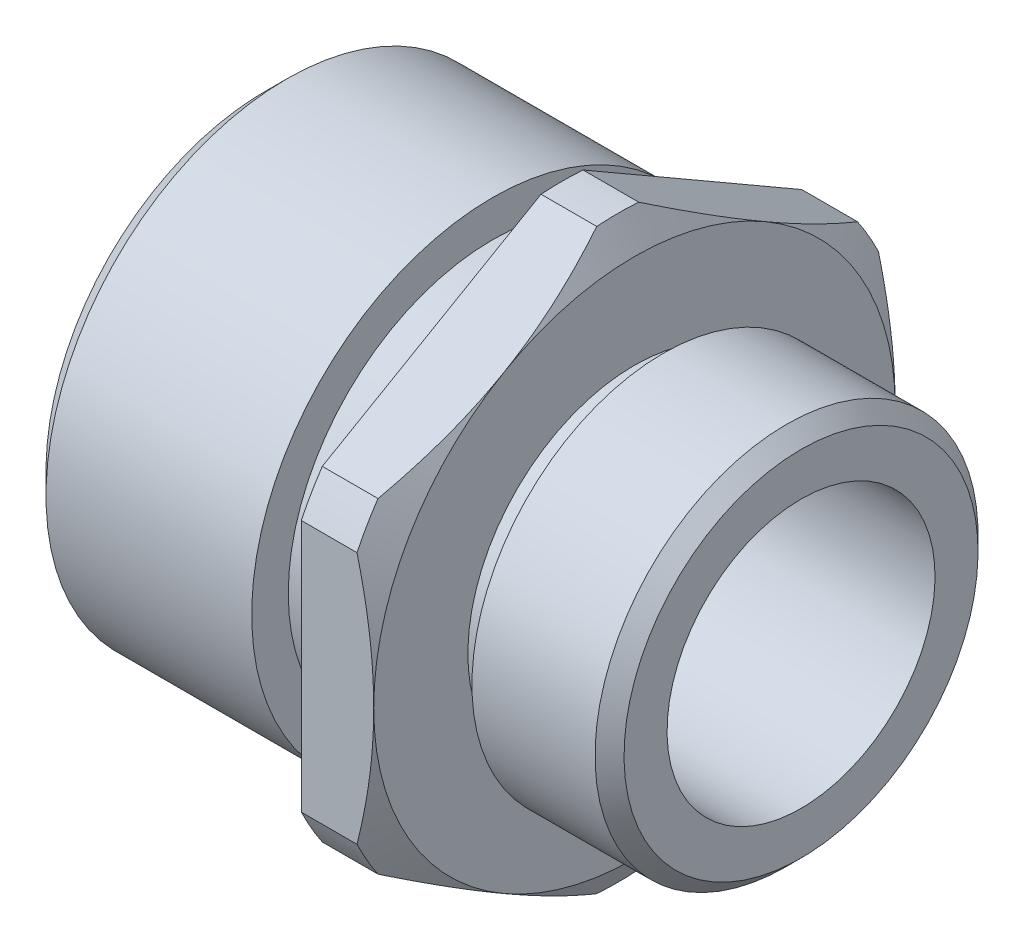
ISO-10303-21;
HEADER;
FILE_DESCRIPTION(('STEP AP214'),'2;1');
FILE_NAME('part.step','',(''),(''),'','','');
FILE_SCHEMA(('AUTOMOTIVE_DESIGN { 1 0 10303 214 1 1 1 1 }'));
ENDSEC;
DATA;
#1=APPLICATION_CONTEXT('core data for automotive mechanical design processes');
#2=APPLICATION_PROTOCOL_DEFINITION('international standard','automotive_design',2000,#1);
#3=PRODUCT_CONTEXT('',#1,'mechanical');
#4=PRODUCT('Part','Part','',(#3));
#5=PRODUCT_RELATED_PRODUCT_CATEGORY('part','',(#4));
#6=PRODUCT_DEFINITION_FORMATION('','',#4);
#7=PRODUCT_DEFINITION_CONTEXT('part definition',#1,'design');
#8=PRODUCT_DEFINITION('design','',#6,#7);
#9=PRODUCT_DEFINITION_SHAPE('','',#8);
#10=(LENGTH_UNIT() NAMED_UNIT(*) SI_UNIT(.MILLI.,.METRE.));
#11=(NAMED_UNIT(*) PLANE_ANGLE_UNIT() SI_UNIT($,.RADIAN.));
#12=(NAMED_UNIT(*) SI_UNIT($,.STERADIAN.) SOLID_ANGLE_UNIT());
#13=UNCERTAINTY_MEASURE_WITH_UNIT(LENGTH_MEASURE(1.E-05),#10,'distance_accuracy_value','');
#14=(GEOMETRIC_REPRESENTATION_CONTEXT(3) GLOBAL_UNCERTAINTY_ASSIGNED_CONTEXT((#13)) GLOBAL_UNIT_ASSIGNED_CONTEXT((#10,
#11,#12)) REPRESENTATION_CONTEXT('',''));
#15=CARTESIAN_POINT('',(0.,0.,0.));
#16=DIRECTION('',(0.,0.,1.));
#17=DIRECTION('',(1.,0.,0.));
#18=AXIS2_PLACEMENT_3D('',#15,#16,#17);
#19=CARTESIAN_POINT('',(-11.5,0.,0.));
#20=DIRECTION('',(-1.,0.,0.));
#21=DIRECTION('',(0.,-1.,0.));
#22=AXIS2_PLACEMENT_3D('',#19,#20,#21);
#23=CONICAL_SURFACE('',#22,18.,1.0471975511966);
#24=CARTESIAN_POINT('',(-12.6547005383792,0.,0.));
#25=DIRECTION('',(1.,0.,0.));
#26=DIRECTION('',(0.,1.,0.));
#27=AXIS2_PLACEMENT_3D('',#24,#25,#26);
#28=CIRCLE('',#27,20.);
#29=CARTESIAN_POINT('',(-12.6547005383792,8.71779788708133,-18.));
#30=VERTEX_POINT('',#29);
#31=CARTESIAN_POINT('',(-12.6547005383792,11.2295583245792,-16.5498344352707));
#32=VERTEX_POINT('',#31);
#33=EDGE_CURVE('E245',#30,#32,#28,.T.);
#34=ORIENTED_EDGE('',*,*,#33,.T.);
#35=CARTESIAN_POINT('',(-12.6549005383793,11.2291609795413,-16.5505226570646));
#36=CARTESIAN_POINT('',(-12.5432286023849,11.4510030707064,-16.1662808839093));
#37=CARTESIAN_POINT('',(-12.4380456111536,11.6736885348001,-15.780578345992));
#38=CARTESIAN_POINT('',(-12.2421753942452,12.1207153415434,-15.0063052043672));
#39=CARTESIAN_POINT('',(-12.151492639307,12.3450571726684,-14.6177337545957));
#40=CARTESIAN_POINT('',(-11.9860966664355,12.7955417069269,-13.8374716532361));
#41=CARTESIAN_POINT('',(-11.9114057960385,13.0216864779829,-13.4457774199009));
#42=CARTESIAN_POINT('',(-11.7796233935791,13.4752388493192,-12.6602016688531));
#43=CARTESIAN_POINT('',(-11.7225300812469,13.7026463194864,-12.2663203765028));
#44=CARTESIAN_POINT('',(-11.6281664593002,14.1537413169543,-11.4850009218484));
#45=CARTESIAN_POINT('',(-11.5905107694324,14.3774085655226,-11.0975978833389));
#46=CARTESIAN_POINT('',(-11.5341212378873,14.8253501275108,-10.3217403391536));
#47=CARTESIAN_POINT('',(-11.5153880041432,15.0496244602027,-9.93328580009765));
#48=CARTESIAN_POINT('',(-11.4973026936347,15.4981814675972,-9.15636227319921));
#49=CARTESIAN_POINT('',(-11.4979342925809,15.7224639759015,-8.76789357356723));
#50=CARTESIAN_POINT('',(-11.5185181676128,16.1707884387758,-7.99137282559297));
#51=CARTESIAN_POINT('',(-11.5384692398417,16.3948304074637,-7.60332075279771));
#52=CARTESIAN_POINT('',(-11.6044909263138,16.8975940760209,-6.73250853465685));
#53=CARTESIAN_POINT('',(-11.6557979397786,17.1761459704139,-6.25004250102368));
#54=CARTESIAN_POINT('',(-11.7859808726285,17.7316768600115,-5.28783477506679));
#55=CARTESIAN_POINT('',(-11.8648629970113,18.008655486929,-4.80809372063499));
#56=CARTESIAN_POINT('',(-12.0489456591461,18.5641863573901,-3.84588602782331));
#57=CARTESIAN_POINT('',(-12.1544829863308,18.8427103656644,-3.36346829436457));
#58=CARTESIAN_POINT('',(-12.388337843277,19.3971791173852,-2.40310024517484));
#59=CARTESIAN_POINT('',(-12.5166406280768,19.6731254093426,-1.92514724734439));
#60=CARTESIAN_POINT('',(-12.6549005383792,19.9477535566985,-1.44947734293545));
#61=B_SPLINE_CURVE_WITH_KNOTS('',3,(#35,#36,#37,#38,#39,#40,#41,#42,#43,#44,#45,#46,#47,#48,#49,
#50,#51,#52,#53,#54,#55,#56,#57,#58,#59,#60),.UNSPECIFIED.,.F.,.F.,(4,2,2,2,2,2,2,2,2,2,2,2,4),
(0.,1.3725940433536,2.74561047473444,4.12053325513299,5.4953168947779,6.84168124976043,
8.18808885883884,9.53336149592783,10.8785503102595,12.5561717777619,14.2341709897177,
15.934536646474,17.6338049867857),.UNSPECIFIED.);
#62=CARTESIAN_POINT('',(-11.5,15.5884572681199,-9.));
#63=VERTEX_POINT('',#62);
#64=EDGE_CURVE('E366',#32,#63,#61,.T.);
#65=ORIENTED_EDGE('',*,*,#64,.T.);
#66=CARTESIAN_POINT('',(-11.5,0.,0.));
#67=DIRECTION('',(1.,0.,0.));
#68=DIRECTION('',(0.,1.,0.));
#69=AXIS2_PLACEMENT_3D('',#66,#67,#68);
#70=CIRCLE('',#69,18.);
#71=CARTESIAN_POINT('',(-11.5,0.,-18.));
#72=VERTEX_POINT('',#71);
#73=EDGE_CURVE('E153',#72,#63,#70,.T.);
#74=ORIENTED_EDGE('',*,*,#73,.F.);
#75=CARTESIAN_POINT('',(-20.0831428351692,-27.4991426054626,-18.));
#76=CARTESIAN_POINT('',(-19.8923878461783,-27.1042498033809,-18.));
#77=CARTESIAN_POINT('',(-19.7026251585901,-26.708877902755,-18.));
#78=CARTESIAN_POINT('',(-19.3253123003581,-25.9170746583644,-18.));
#79=CARTESIAN_POINT('',(-19.1377621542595,-25.5206433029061,-18.));
#80=CARTESIAN_POINT('',(-18.5787176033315,-24.3294911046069,-18.));
#81=CARTESIAN_POINT('',(-18.210891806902,-23.5330415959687,-18.));
#82=CARTESIAN_POINT('',(-17.485292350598,-21.9300278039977,-18.));
#83=CARTESIAN_POINT('',(-17.1275888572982,-21.1234316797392,-18.));
#84=CARTESIAN_POINT('',(-16.4276306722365,-19.5035874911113,-18.));
#85=CARTESIAN_POINT('',(-16.0853751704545,-18.6903397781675,-18.));
#86=CARTESIAN_POINT('',(-15.416489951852,-17.0460964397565,-18.));
#87=CARTESIAN_POINT('',(-15.0900950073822,-16.2150048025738,-18.));
#88=CARTESIAN_POINT('',(-14.4630243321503,-14.5429906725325,-18.));
#89=CARTESIAN_POINT('',(-14.162351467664,-13.702067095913,-18.));
#90=CARTESIAN_POINT('',(-13.5948538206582,-12.0108273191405,-18.));
#91=CARTESIAN_POINT('',(-13.3279565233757,-11.160535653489,-18.));
#92=CARTESIAN_POINT('',(-12.8367057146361,-9.4477849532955,-18.));
#93=CARTESIAN_POINT('',(-12.6123386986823,-8.58532987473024,-18.));
#94=CARTESIAN_POINT('',(-12.3159268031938,-7.28235631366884,-18.));
#95=CARTESIAN_POINT('',(-12.2237952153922,-6.84637691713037,-18.));
#96=CARTESIAN_POINT('',(-12.0543745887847,-5.97152919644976,-18.));
#97=CARTESIAN_POINT('',(-11.9770852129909,-5.53266093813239,-18.));
#98=CARTESIAN_POINT('',(-11.8387227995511,-4.65233465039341,-18.));
#99=CARTESIAN_POINT('',(-11.7776507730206,-4.21087646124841,-18.));
#100=CARTESIAN_POINT('',(-11.6729517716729,-3.32588120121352,-18.));
#101=CARTESIAN_POINT('',(-11.6293248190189,-2.88234412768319,-18.));
#102=CARTESIAN_POINT('',(-11.5606870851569,-1.99661694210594,-18.));
#103=CARTESIAN_POINT('',(-11.5355614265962,-1.55443579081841,-18.));
#104=CARTESIAN_POINT('',(-11.5040574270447,-0.669408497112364,-18.));
#105=CARTESIAN_POINT('',(-11.4976788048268,-0.226562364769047,-18.));
#106=CARTESIAN_POINT('',(-11.503819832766,0.658879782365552,-18.));
#107=CARTESIAN_POINT('',(-11.5163343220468,1.10147583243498,-18.));
#108=CARTESIAN_POINT('',(-11.5599522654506,1.98575279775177,-18.));
#109=CARTESIAN_POINT('',(-11.5910565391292,2.42743367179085,-18.));
#110=CARTESIAN_POINT('',(-11.6884816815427,3.49963238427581,-18.));
#111=CARTESIAN_POINT('',(-11.7642107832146,4.12931183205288,-18.));
#112=CARTESIAN_POINT('',(-11.9492205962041,5.38369556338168,-18.));
#113=CARTESIAN_POINT('',(-12.0585063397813,6.00839908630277,-18.));
#114=CARTESIAN_POINT('',(-12.4312120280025,7.8761564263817,-18.));
#115=CARTESIAN_POINT('',(-12.7392300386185,9.1104114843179,-18.));
#116=CARTESIAN_POINT('',(-13.2698190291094,10.9565279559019,-18.));
#117=CARTESIAN_POINT('',(-13.460684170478,11.5780480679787,-18.));
#118=CARTESIAN_POINT('',(-13.8613113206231,12.815083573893,-18.));
#119=CARTESIAN_POINT('',(-14.0710750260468,13.4305984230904,-18.));
#120=CARTESIAN_POINT('',(-14.5050398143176,14.65255311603,-18.));
#121=CARTESIAN_POINT('',(-14.7291525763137,15.2590245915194,-18.));
#122=CARTESIAN_POINT('',(-15.0749595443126,16.1649196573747,-18.));
#123=CARTESIAN_POINT('',(-15.1918151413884,16.466200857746,-18.));
#124=CARTESIAN_POINT('',(-15.4284778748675,17.0675954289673,-18.));
#125=CARTESIAN_POINT('',(-15.5482849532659,17.3677088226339,-18.));
#126=CARTESIAN_POINT('',(-15.6694343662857,17.667278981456,-18.));
#127=B_SPLINE_CURVE_WITH_KNOTS('',3,(#75,#76,#77,#78,#79,#80,#81,#82,#83,#84,#85,#86,#87,#88,
#89,#90,#91,#92,#93,#94,#95,#96,#97,#98,#99,#100,#101,#102,#103,#104,#105,#106,#107,#108,#109,
#110,#111,#112,#113,#114,#115,#116,#117,#118,#119,#120,#121,#122,#123,#124,#125,#126),
.UNSPECIFIED.,.F.,.F.,(4,2,2,2,2,2,2,2,2,2,2,2,2,2,2,2,2,2,2,2,2,2,2,2,2,4),(0.,
1.31565319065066,2.63132096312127,5.26308805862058,7.91002567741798,10.5568243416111,
13.2351598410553,15.913793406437,18.5865748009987,21.2585060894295,22.595117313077,
23.9316981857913,25.2683623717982,26.6050282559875,27.9333229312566,29.2615976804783,
30.5895096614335,31.9174801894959,33.8190492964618,35.7209037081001,39.5319547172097,
41.4823037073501,43.4328279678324,45.3723255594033,46.3417605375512,47.3111764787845),.UNSPECIFIED.);
#128=EDGE_CURVE('E276',#72,#30,#127,.T.);
#129=ORIENTED_EDGE('',*,*,#128,.T.);
#130=EDGE_LOOP('',(#34,#65,#74,#129));
#131=FACE_BOUND('',#130,.T.);
#132=ADVANCED_FACE('F16',(#131),#23,.T.);
#133=CARTESIAN_POINT('',(-11.5,15.5884572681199,9.));
#134=VERTEX_POINT('',#133);
#135=EDGE_CURVE('E140',#63,#134,#70,.T.);
#136=ORIENTED_EDGE('',*,*,#135,.F.);
#137=CARTESIAN_POINT('',(-12.6547005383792,19.9473562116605,-1.45016556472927));
#138=VERTEX_POINT('',#137);
#139=EDGE_CURVE('E372',#63,#138,#61,.T.);
#140=ORIENTED_EDGE('',*,*,#139,.T.);
#141=CARTESIAN_POINT('',(-12.6547005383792,19.9473562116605,1.45016556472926));
#142=VERTEX_POINT('',#141);
#143=EDGE_CURVE('E143',#138,#142,#28,.T.);
#144=ORIENTED_EDGE('',*,*,#143,.T.);
#145=CARTESIAN_POINT('',(-12.6549005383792,19.9477535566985,1.44947734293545));
#146=CARTESIAN_POINT('',(-12.5432286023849,19.7259114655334,1.83371911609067));
#147=CARTESIAN_POINT('',(-12.4380456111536,19.5032260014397,2.21942165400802));
#148=CARTESIAN_POINT('',(-12.2421753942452,19.0561991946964,2.99369479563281));
#149=CARTESIAN_POINT('',(-12.151492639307,18.8318573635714,3.38226624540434));
#150=CARTESIAN_POINT('',(-11.9860966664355,18.3813728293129,4.16252834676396));
#151=CARTESIAN_POINT('',(-11.9114057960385,18.1552280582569,4.5542225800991));
#152=CARTESIAN_POINT('',(-11.7796233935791,17.7016756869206,5.33979833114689));
#153=CARTESIAN_POINT('',(-11.7225300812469,17.4742682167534,5.73367962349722));
#154=CARTESIAN_POINT('',(-11.6281664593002,17.0231732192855,6.51499907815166));
#155=CARTESIAN_POINT('',(-11.5905107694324,16.7995059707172,6.90240211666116));
#156=CARTESIAN_POINT('',(-11.5341212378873,16.351564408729,7.67825966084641));
#157=CARTESIAN_POINT('',(-11.5153880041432,16.1272900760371,8.06671419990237));
#158=CARTESIAN_POINT('',(-11.4973026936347,15.6787330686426,8.84363772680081));
#159=CARTESIAN_POINT('',(-11.4979342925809,15.4544505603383,9.2321064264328));
#160=CARTESIAN_POINT('',(-11.5185181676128,15.006126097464,10.0086271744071));
#161=CARTESIAN_POINT('',(-11.5384692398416,14.7820841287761,10.3966792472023));
#162=CARTESIAN_POINT('',(-11.6044909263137,14.2793204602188,11.2674914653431));
#163=CARTESIAN_POINT('',(-11.6557979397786,14.0007685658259,11.7499574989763));
#164=CARTESIAN_POINT('',(-11.7859808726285,13.4452376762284,12.7121652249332));
#165=CARTESIAN_POINT('',(-11.8648629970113,13.1682590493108,13.191906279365));
#166=CARTESIAN_POINT('',(-12.0489456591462,12.6127281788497,14.1541139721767));
#167=CARTESIAN_POINT('',(-12.1544829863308,12.3342041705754,14.6365317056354));
#168=CARTESIAN_POINT('',(-12.388337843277,11.7797354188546,15.5968997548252));
#169=CARTESIAN_POINT('',(-12.5166406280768,11.5037891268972,16.0748527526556));
#170=CARTESIAN_POINT('',(-12.6549005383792,11.2291609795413,16.5505226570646));
#171=B_SPLINE_CURVE_WITH_KNOTS('',3,(#145,#146,#147,#148,#149,#150,#151,#152,#153,#154,#155,
#156,#157,#158,#159,#160,#161,#162,#163,#164,#165,#166,#167,#168,#169,#170),.UNSPECIFIED.,.F.,
.F.,(4,2,2,2,2,2,2,2,2,2,2,2,4),(0.,1.37259404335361,2.74561047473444,4.120533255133,
5.49531689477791,6.84168124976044,8.18808885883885,9.53336149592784,10.8785503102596,
12.5561717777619,14.2341709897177,15.934536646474,17.6338049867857),.UNSPECIFIED.);
#172=EDGE_CURVE('E125',#142,#134,#171,.T.);
#173=ORIENTED_EDGE('',*,*,#172,.T.);
#174=EDGE_LOOP('',(#136,#140,#144,#173));
#175=FACE_BOUND('',#174,.T.);
#176=ADVANCED_FACE('F138',(#175),#23,.T.);
#177=CARTESIAN_POINT('',(-12.6547005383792,-11.2295583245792,-16.5498344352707));
#178=VERTEX_POINT('',#177);
#179=CARTESIAN_POINT('',(-12.6547005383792,-8.71779788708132,-18.));
#180=VERTEX_POINT('',#179);
#181=EDGE_CURVE('E361',#178,#180,#28,.T.);
#182=ORIENTED_EDGE('',*,*,#181,.T.);
#183=EDGE_CURVE('E278',#180,#72,#127,.T.);
#184=ORIENTED_EDGE('',*,*,#183,.T.);
#185=CARTESIAN_POINT('',(-11.5,-15.5884572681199,-9.));
#186=VERTEX_POINT('',#185);
#187=EDGE_CURVE('E369',#186,#72,#70,.T.);
#188=ORIENTED_EDGE('',*,*,#187,.F.);
#189=CARTESIAN_POINT('',(-12.6549005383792,-19.9477535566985,-1.44947734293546));
#190=CARTESIAN_POINT('',(-12.5432286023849,-19.7259114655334,-1.83371911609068));
#191=CARTESIAN_POINT('',(-12.4380456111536,-19.5032260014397,-2.21942165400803));
#192=CARTESIAN_POINT('',(-12.2421753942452,-19.0561991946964,-2.99369479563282));
#193=CARTESIAN_POINT('',(-12.151492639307,-18.8318573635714,-3.38226624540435));
#194=CARTESIAN_POINT('',(-11.9860966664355,-18.3813728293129,-4.16252834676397));
#195=CARTESIAN_POINT('',(-11.9114057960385,-18.1552280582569,-4.55422258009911));
#196=CARTESIAN_POINT('',(-11.7796233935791,-17.7016756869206,-5.33979833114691));
#197=CARTESIAN_POINT('',(-11.7225300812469,-17.4742682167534,-5.73367962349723));
#198=CARTESIAN_POINT('',(-11.6281664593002,-17.0231732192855,-6.51499907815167));
#199=CARTESIAN_POINT('',(-11.5905107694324,-16.7995059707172,-6.90240211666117));
#200=CARTESIAN_POINT('',(-11.5341212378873,-16.351564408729,-7.67825966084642));
#201=CARTESIAN_POINT('',(-11.5153880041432,-16.1272900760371,-8.06671419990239));
#202=CARTESIAN_POINT('',(-11.4973026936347,-15.6787330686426,-8.84363772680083));
#203=CARTESIAN_POINT('',(-11.4979342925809,-15.4544505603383,-9.23210642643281));
#204=CARTESIAN_POINT('',(-11.5185181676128,-15.006126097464,-10.0086271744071));
#205=CARTESIAN_POINT('',(-11.5384692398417,-14.7820841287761,-10.3966792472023));
#206=CARTESIAN_POINT('',(-11.6044909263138,-14.2793204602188,-11.2674914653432));
#207=CARTESIAN_POINT('',(-11.6557979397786,-14.0007685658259,-11.7499574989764));
#208=CARTESIAN_POINT('',(-11.7859808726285,-13.4452376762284,-12.7121652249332));
#209=CARTESIAN_POINT('',(-11.8648629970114,-13.1682590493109,-13.191906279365));
#210=CARTESIAN_POINT('',(-12.0489456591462,-12.6127281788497,-14.1541139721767));
#211=CARTESIAN_POINT('',(-12.1544829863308,-12.3342041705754,-14.6365317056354));
#212=CARTESIAN_POINT('',(-12.388337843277,-11.7797354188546,-15.5968997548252));
#213=CARTESIAN_POINT('',(-12.5166406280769,-11.5037891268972,-16.0748527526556));
#214=CARTESIAN_POINT('',(-12.6549005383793,-11.2291609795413,-16.5505226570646));
#215=B_SPLINE_CURVE_WITH_KNOTS('',3,(#189,#190,#191,#192,#193,#194,#195,#196,#197,#198,#199,
#200,#201,#202,#203,#204,#205,#206,#207,#208,#209,#210,#211,#212,#213,#214),.UNSPECIFIED.,.F.,
.F.,(4,2,2,2,2,2,2,2,2,2,2,2,4),(0.,1.3725940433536,2.74561047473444,4.120533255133,
5.4953168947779,6.84168124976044,8.18808885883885,9.53336149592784,10.8785503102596,
12.5561717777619,14.2341709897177,15.934536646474,17.6338049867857),.UNSPECIFIED.);
#216=EDGE_CURVE('E306',#186,#178,#215,.T.);
#217=ORIENTED_EDGE('',*,*,#216,.T.);
#218=EDGE_LOOP('',(#182,#184,#188,#217));
#219=FACE_BOUND('',#218,.T.);
#220=ADVANCED_FACE('F368',(#219),#23,.T.);
#221=CARTESIAN_POINT('',(-12.6547005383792,-19.9473562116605,1.45016556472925));
#222=VERTEX_POINT('',#221);
#223=CARTESIAN_POINT('',(-12.6547005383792,-19.9473562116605,-1.45016556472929));
#224=VERTEX_POINT('',#223);
#225=EDGE_CURVE('E358',#222,#224,#28,.T.);
#226=ORIENTED_EDGE('',*,*,#225,.T.);
#227=EDGE_CURVE('E280',#224,#186,#215,.T.);
#228=ORIENTED_EDGE('',*,*,#227,.T.);
#229=CARTESIAN_POINT('',(-11.5,-15.5884572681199,9.));
#230=VERTEX_POINT('',#229);
#231=EDGE_CURVE('E165',#230,#186,#70,.T.);
#232=ORIENTED_EDGE('',*,*,#231,.F.);
#233=CARTESIAN_POINT('',(-12.6549005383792,-11.2291609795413,16.5505226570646));
#234=CARTESIAN_POINT('',(-12.5432286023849,-11.4510030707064,16.1662808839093));
#235=CARTESIAN_POINT('',(-12.4380456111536,-11.6736885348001,15.780578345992));
#236=CARTESIAN_POINT('',(-12.2421753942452,-12.1207153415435,15.0063052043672));
#237=CARTESIAN_POINT('',(-12.151492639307,-12.3450571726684,14.6177337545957));
#238=CARTESIAN_POINT('',(-11.9860966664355,-12.7955417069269,13.8374716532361));
#239=CARTESIAN_POINT('',(-11.9114057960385,-13.0216864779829,13.4457774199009));
#240=CARTESIAN_POINT('',(-11.7796233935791,-13.4752388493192,12.6602016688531));
#241=CARTESIAN_POINT('',(-11.7225300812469,-13.7026463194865,12.2663203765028));
#242=CARTESIAN_POINT('',(-11.6281664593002,-14.1537413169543,11.4850009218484));
#243=CARTESIAN_POINT('',(-11.5905107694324,-14.3774085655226,11.0975978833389));
#244=CARTESIAN_POINT('',(-11.5341212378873,-14.8253501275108,10.3217403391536));
#245=CARTESIAN_POINT('',(-11.5153880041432,-15.0496244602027,9.93328580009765));
#246=CARTESIAN_POINT('',(-11.4973026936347,-15.4981814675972,9.15636227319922));
#247=CARTESIAN_POINT('',(-11.4979342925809,-15.7224639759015,8.76789357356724));
#248=CARTESIAN_POINT('',(-11.5185181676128,-16.1707884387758,7.99137282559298));
#249=CARTESIAN_POINT('',(-11.5384692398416,-16.3948304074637,7.60332075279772));
#250=CARTESIAN_POINT('',(-11.6044909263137,-16.8975940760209,6.73250853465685));
#251=CARTESIAN_POINT('',(-11.6557979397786,-17.1761459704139,6.25004250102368));
#252=CARTESIAN_POINT('',(-11.7859808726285,-17.7316768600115,5.28783477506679));
#253=CARTESIAN_POINT('',(-11.8648629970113,-18.008655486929,4.80809372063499));
#254=CARTESIAN_POINT('',(-12.0489456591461,-18.5641863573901,3.8458860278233));
#255=CARTESIAN_POINT('',(-12.1544829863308,-18.8427103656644,3.36346829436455));
#256=CARTESIAN_POINT('',(-12.388337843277,-19.3971791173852,2.40310024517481));
#257=CARTESIAN_POINT('',(-12.5166406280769,-19.6731254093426,1.92514724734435));
#258=CARTESIAN_POINT('',(-12.6549005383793,-19.9477535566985,1.4494773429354));
#259=B_SPLINE_CURVE_WITH_KNOTS('',3,(#233,#234,#235,#236,#237,#238,#239,#240,#241,#242,#243,
#244,#245,#246,#247,#248,#249,#250,#251,#252,#253,#254,#255,#256,#257,#258),.UNSPECIFIED.,.F.,
.F.,(4,2,2,2,2,2,2,2,2,2,2,2,4),(0.,1.3725940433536,2.74561047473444,4.12053325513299,
5.49531689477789,6.84168124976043,8.18808885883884,9.53336149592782,10.8785503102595,
12.5561717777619,14.2341709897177,15.934536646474,17.6338049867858),.UNSPECIFIED.);
#260=EDGE_CURVE('E316',#230,#222,#259,.T.);
#261=ORIENTED_EDGE('',*,*,#260,.T.);
#262=EDGE_LOOP('',(#226,#228,#232,#261));
#263=FACE_BOUND('',#262,.T.);
#264=ADVANCED_FACE('F412',(#263),#23,.T.);
#265=CARTESIAN_POINT('',(-12.6547005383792,-8.71779788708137,18.));
#266=VERTEX_POINT('',#265);
#267=CARTESIAN_POINT('',(-12.6547005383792,-11.2295583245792,16.5498344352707));
#268=VERTEX_POINT('',#267);
#269=EDGE_CURVE('E353',#266,#268,#28,.T.);
#270=ORIENTED_EDGE('',*,*,#269,.T.);
#271=EDGE_CURVE('E315',#268,#230,#259,.T.);
#272=ORIENTED_EDGE('',*,*,#271,.T.);
#273=CARTESIAN_POINT('',(-11.5,0.,18.));
#274=VERTEX_POINT('',#273);
#275=EDGE_CURVE('E161',#274,#230,#70,.T.);
#276=ORIENTED_EDGE('',*,*,#275,.F.);
#277=CARTESIAN_POINT('',(-20.0831428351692,-27.4991426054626,18.));
#278=CARTESIAN_POINT('',(-19.8923878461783,-27.1042498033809,18.));
#279=CARTESIAN_POINT('',(-19.7026251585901,-26.708877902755,18.));
#280=CARTESIAN_POINT('',(-19.3253123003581,-25.9170746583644,18.));
#281=CARTESIAN_POINT('',(-19.1377621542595,-25.5206433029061,18.));
#282=CARTESIAN_POINT('',(-18.5787176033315,-24.3294911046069,18.));
#283=CARTESIAN_POINT('',(-18.210891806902,-23.5330415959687,18.));
#284=CARTESIAN_POINT('',(-17.485292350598,-21.9300278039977,18.));
#285=CARTESIAN_POINT('',(-17.1275888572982,-21.1234316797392,18.));
#286=CARTESIAN_POINT('',(-16.4276306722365,-19.5035874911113,18.));
#287=CARTESIAN_POINT('',(-16.0853751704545,-18.6903397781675,18.));
#288=CARTESIAN_POINT('',(-15.4164899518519,-17.0460964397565,18.));
#289=CARTESIAN_POINT('',(-15.0900950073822,-16.2150048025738,18.));
#290=CARTESIAN_POINT('',(-14.4630243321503,-14.5429906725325,18.));
#291=CARTESIAN_POINT('',(-14.162351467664,-13.702067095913,18.));
#292=CARTESIAN_POINT('',(-13.5948538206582,-12.0108273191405,18.));
#293=CARTESIAN_POINT('',(-13.3279565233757,-11.160535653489,18.));
#294=CARTESIAN_POINT('',(-12.8367057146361,-9.44778495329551,18.));
#295=CARTESIAN_POINT('',(-12.6123386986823,-8.58532987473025,18.));
#296=CARTESIAN_POINT('',(-12.3159268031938,-7.28235631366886,18.));
#297=CARTESIAN_POINT('',(-12.2237952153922,-6.84637691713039,18.));
#298=CARTESIAN_POINT('',(-12.0543745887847,-5.97152919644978,18.));
#299=CARTESIAN_POINT('',(-11.9770852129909,-5.53266093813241,18.));
#300=CARTESIAN_POINT('',(-11.8387227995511,-4.65233465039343,18.));
#301=CARTESIAN_POINT('',(-11.7776507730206,-4.21087646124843,18.));
#302=CARTESIAN_POINT('',(-11.6729517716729,-3.32588120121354,18.));
#303=CARTESIAN_POINT('',(-11.6293248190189,-2.88234412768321,18.));
#304=CARTESIAN_POINT('',(-11.5606870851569,-1.99661694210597,18.));
#305=CARTESIAN_POINT('',(-11.5355614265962,-1.55443579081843,18.));
#306=CARTESIAN_POINT('',(-11.5040574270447,-0.669408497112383,18.));
#307=CARTESIAN_POINT('',(-11.4976788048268,-0.226562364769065,18.));
#308=CARTESIAN_POINT('',(-11.503819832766,0.658879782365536,18.));
#309=CARTESIAN_POINT('',(-11.5163343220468,1.10147583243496,18.));
#310=CARTESIAN_POINT('',(-11.5599522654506,1.98575279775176,18.));
#311=CARTESIAN_POINT('',(-11.5910565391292,2.42743367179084,18.));
#312=CARTESIAN_POINT('',(-11.6884816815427,3.4996323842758,18.));
#313=CARTESIAN_POINT('',(-11.7642107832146,4.12931183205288,18.));
#314=CARTESIAN_POINT('',(-11.9492205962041,5.38369556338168,18.));
#315=CARTESIAN_POINT('',(-12.0585063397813,6.00839908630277,18.));
#316=CARTESIAN_POINT('',(-12.4312120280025,7.87615642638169,18.));
#317=CARTESIAN_POINT('',(-12.7392300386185,9.1104114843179,18.));
#318=CARTESIAN_POINT('',(-13.2698190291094,10.9565279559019,18.));
#319=CARTESIAN_POINT('',(-13.460684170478,11.5780480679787,18.));
#320=CARTESIAN_POINT('',(-13.8613113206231,12.815083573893,18.));
#321=CARTESIAN_POINT('',(-14.0710750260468,13.4305984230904,18.));
#322=CARTESIAN_POINT('',(-14.5050398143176,14.65255311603,18.));
#323=CARTESIAN_POINT('',(-14.7291525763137,15.2590245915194,18.));
#324=CARTESIAN_POINT('',(-15.0749595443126,16.1649196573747,18.));
#325=CARTESIAN_POINT('',(-15.1918151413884,16.466200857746,18.));
#326=CARTESIAN_POINT('',(-15.4284778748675,17.0675954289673,18.));
#327=CARTESIAN_POINT('',(-15.5482849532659,17.3677088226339,18.));
#328=CARTESIAN_POINT('',(-15.6694343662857,17.667278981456,18.));
#329=B_SPLINE_CURVE_WITH_KNOTS('',3,(#277,#278,#279,#280,#281,#282,#283,#284,#285,#286,#287,
#288,#289,#290,#291,#292,#293,#294,#295,#296,#297,#298,#299,#300,#301,#302,#303,#304,#305,#306,
#307,#308,#309,#310,#311,#312,#313,#314,#315,#316,#317,#318,#319,#320,#321,#322,#323,#324,#325,
#326,#327,#328),.UNSPECIFIED.,.F.,.F.,(4,2,2,2,2,2,2,2,2,2,2,2,2,2,2,2,2,2,2,2,2,2,2,2,2,4),(0.,
1.31565319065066,2.63132096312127,5.26308805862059,7.91002567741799,10.5568243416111,
13.2351598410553,15.913793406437,18.5865748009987,21.2585060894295,22.595117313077,
23.9316981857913,25.2683623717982,26.6050282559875,27.9333229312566,29.2615976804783,
30.5895096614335,31.9174801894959,33.8190492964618,35.7209037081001,39.5319547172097,
41.4823037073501,43.4328279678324,45.3723255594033,46.3417605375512,47.3111764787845),.UNSPECIFIED.);
#330=EDGE_CURVE('E326',#274,#266,#329,.F.);
#331=ORIENTED_EDGE('',*,*,#330,.T.);
#332=EDGE_LOOP('',(#270,#272,#276,#331));
#333=FACE_BOUND('',#332,.T.);
#334=ADVANCED_FACE('F406',(#333),#23,.T.);
#335=CARTESIAN_POINT('',(-12.6547005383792,11.2295583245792,16.5498344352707));
#336=VERTEX_POINT('',#335);
#337=CARTESIAN_POINT('',(-12.6547005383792,8.71779788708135,18.));
#338=VERTEX_POINT('',#337);
#339=EDGE_CURVE('E154',#336,#338,#28,.T.);
#340=ORIENTED_EDGE('',*,*,#339,.T.);
#341=EDGE_CURVE('E158',#338,#274,#329,.F.);
#342=ORIENTED_EDGE('',*,*,#341,.T.);
#343=EDGE_CURVE('E150',#134,#274,#70,.T.);
#344=ORIENTED_EDGE('',*,*,#343,.F.);
#345=EDGE_CURVE('E122',#134,#336,#171,.T.);
#346=ORIENTED_EDGE('',*,*,#345,.T.);
#347=EDGE_LOOP('',(#340,#342,#344,#346));
#348=FACE_BOUND('',#347,.T.);
#349=ADVANCED_FACE('F157',(#348),#23,.T.);
#350=CARTESIAN_POINT('',(0.,0.,0.));
#351=DIRECTION('',(1.,0.,0.));
#352=DIRECTION('',(0.,1.,0.));
#353=AXIS2_PLACEMENT_3D('',#350,#351,#352);
#354=CYLINDRICAL_SURFACE('',#353,20.);
#355=ORIENTED_EDGE('',*,*,#143,.F.);
#356=DIRECTION('',(1.,0.,0.));
#357=VECTOR('',#356,1.);
#358=CARTESIAN_POINT('',(0.,19.9473562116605,-1.45016556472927));
#359=LINE('',#358,#357);
#360=CARTESIAN_POINT('',(-16.5,19.9473562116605,-1.45016556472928));
#361=VERTEX_POINT('',#360);
#362=EDGE_CURVE('E371',#138,#361,#359,.F.);
#363=ORIENTED_EDGE('',*,*,#362,.T.);
#364=CARTESIAN_POINT('',(-16.5,0.,0.));
#365=DIRECTION('',(1.,0.,0.));
#366=DIRECTION('',(0.,1.,0.));
#367=AXIS2_PLACEMENT_3D('',#364,#365,#366);
#368=CIRCLE('',#367,20.);
#369=CARTESIAN_POINT('',(-16.5,19.9473562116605,1.45016556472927));
#370=VERTEX_POINT('',#369);
#371=EDGE_CURVE('E231',#361,#370,#368,.T.);
#372=ORIENTED_EDGE('',*,*,#371,.T.);
#373=DIRECTION('',(1.,0.,0.));
#374=VECTOR('',#373,1.);
#375=CARTESIAN_POINT('',(0.,19.9473562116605,1.45016556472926));
#376=LINE('',#375,#374);
#377=EDGE_CURVE('E576',#370,#142,#376,.T.);
#378=ORIENTED_EDGE('',*,*,#377,.T.);
#379=EDGE_LOOP('',(#355,#363,#372,#378));
#380=FACE_BOUND('',#379,.T.);
#381=ADVANCED_FACE('F405',(#380),#354,.T.);
#382=CARTESIAN_POINT('',(-16.5,8.71779788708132,-18.));
#383=VERTEX_POINT('',#382);
#384=CARTESIAN_POINT('',(-16.5,11.2295583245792,-16.5498344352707));
#385=VERTEX_POINT('',#384);
#386=EDGE_CURVE('E233',#383,#385,#368,.T.);
#387=ORIENTED_EDGE('',*,*,#386,.T.);
#388=DIRECTION('',(1.,0.,0.));
#389=VECTOR('',#388,1.);
#390=CARTESIAN_POINT('',(0.,11.2295583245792,-16.5498344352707));
#391=LINE('',#390,#389);
#392=EDGE_CURVE('E31',#385,#32,#391,.T.);
#393=ORIENTED_EDGE('',*,*,#392,.T.);
#394=ORIENTED_EDGE('',*,*,#33,.F.);
#395=DIRECTION('',(1.,0.,0.));
#396=VECTOR('',#395,1.);
#397=CARTESIAN_POINT('',(0.,8.71779788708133,-18.));
#398=LINE('',#397,#396);
#399=EDGE_CURVE('E270',#30,#383,#398,.F.);
#400=ORIENTED_EDGE('',*,*,#399,.T.);
#401=EDGE_LOOP('',(#387,#393,#394,#400));
#402=FACE_BOUND('',#401,.T.);
#403=ADVANCED_FACE('F274',(#402),#354,.T.);
#404=CARTESIAN_POINT('',(-16.5,-11.2295583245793,-16.5498344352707));
#405=VERTEX_POINT('',#404);
#406=CARTESIAN_POINT('',(-16.5,-8.71779788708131,-18.));
#407=VERTEX_POINT('',#406);
#408=EDGE_CURVE('E239',#405,#407,#368,.T.);
#409=ORIENTED_EDGE('',*,*,#408,.T.);
#410=DIRECTION('',(1.,0.,0.));
#411=VECTOR('',#410,1.);
#412=CARTESIAN_POINT('',(0.,-8.71779788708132,-18.));
#413=LINE('',#412,#411);
#414=EDGE_CURVE('E39',#407,#180,#413,.T.);
#415=ORIENTED_EDGE('',*,*,#414,.T.);
#416=ORIENTED_EDGE('',*,*,#181,.F.);
#417=DIRECTION('',(1.,0.,0.));
#418=VECTOR('',#417,1.);
#419=CARTESIAN_POINT('',(0.,-11.2295583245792,-16.5498344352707));
#420=LINE('',#419,#418);
#421=EDGE_CURVE('E264',#178,#405,#420,.F.);
#422=ORIENTED_EDGE('',*,*,#421,.T.);
#423=EDGE_LOOP('',(#409,#415,#416,#422));
#424=FACE_BOUND('',#423,.T.);
#425=ADVANCED_FACE('F261',(#424),#354,.T.);
#426=CARTESIAN_POINT('',(-16.5,-19.9473562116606,1.45016556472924));
#427=VERTEX_POINT('',#426);
#428=CARTESIAN_POINT('',(-16.5,-19.9473562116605,-1.4501655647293));
#429=VERTEX_POINT('',#428);
#430=EDGE_CURVE('E247',#427,#429,#368,.T.);
#431=ORIENTED_EDGE('',*,*,#430,.T.);
#432=DIRECTION('',(1.,0.,0.));
#433=VECTOR('',#432,1.);
#434=CARTESIAN_POINT('',(0.,-19.9473562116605,-1.45016556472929));
#435=LINE('',#434,#433);
#436=EDGE_CURVE('E313',#429,#224,#435,.T.);
#437=ORIENTED_EDGE('',*,*,#436,.T.);
#438=ORIENTED_EDGE('',*,*,#225,.F.);
#439=DIRECTION('',(1.,0.,0.));
#440=VECTOR('',#439,1.);
#441=CARTESIAN_POINT('',(0.,-19.9473562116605,1.45016556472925));
#442=LINE('',#441,#440);
#443=EDGE_CURVE('E322',#222,#427,#442,.F.);
#444=ORIENTED_EDGE('',*,*,#443,.T.);
#445=EDGE_LOOP('',(#431,#437,#438,#444));
#446=FACE_BOUND('',#445,.T.);
#447=ADVANCED_FACE('F356',(#446),#354,.T.);
#448=CARTESIAN_POINT('',(-16.5,-8.71779788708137,18.));
#449=VERTEX_POINT('',#448);
#450=CARTESIAN_POINT('',(-16.5,-11.2295583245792,16.5498344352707));
#451=VERTEX_POINT('',#450);
#452=EDGE_CURVE('E241',#449,#451,#368,.T.);
#453=ORIENTED_EDGE('',*,*,#452,.T.);
#454=DIRECTION('',(1.,0.,0.));
#455=VECTOR('',#454,1.);
#456=CARTESIAN_POINT('',(0.,-11.2295583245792,16.5498344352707));
#457=LINE('',#456,#455);
#458=EDGE_CURVE('E324',#451,#268,#457,.T.);
#459=ORIENTED_EDGE('',*,*,#458,.T.);
#460=ORIENTED_EDGE('',*,*,#269,.F.);
#461=DIRECTION('',(1.,0.,0.));
#462=VECTOR('',#461,1.);
#463=CARTESIAN_POINT('',(0.,-8.71779788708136,18.));
#464=LINE('',#463,#462);
#465=EDGE_CURVE('E332',#266,#449,#464,.F.);
#466=ORIENTED_EDGE('',*,*,#465,.T.);
#467=EDGE_LOOP('',(#453,#459,#460,#466));
#468=FACE_BOUND('',#467,.T.);
#469=ADVANCED_FACE('F351',(#468),#354,.T.);
#470=CARTESIAN_POINT('',(-16.5,11.2295583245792,16.5498344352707));
#471=VERTEX_POINT('',#470);
#472=CARTESIAN_POINT('',(-16.5,8.71779788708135,18.));
#473=VERTEX_POINT('',#472);
#474=EDGE_CURVE('E234',#471,#473,#368,.T.);
#475=ORIENTED_EDGE('',*,*,#474,.T.);
#476=DIRECTION('',(1.,0.,0.));
#477=VECTOR('',#476,1.);
#478=CARTESIAN_POINT('',(0.,8.71779788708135,18.));
#479=LINE('',#478,#477);
#480=EDGE_CURVE('E144',#473,#338,#479,.T.);
#481=ORIENTED_EDGE('',*,*,#480,.T.);
#482=ORIENTED_EDGE('',*,*,#339,.F.);
#483=DIRECTION('',(1.,0.,0.));
#484=VECTOR('',#483,1.);
#485=CARTESIAN_POINT('',(0.,11.2295583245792,16.5498344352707));
#486=LINE('',#485,#484);
#487=EDGE_CURVE('E128',#336,#471,#486,.F.);
#488=ORIENTED_EDGE('',*,*,#487,.T.);
#489=EDGE_LOOP('',(#475,#481,#482,#488));
#490=FACE_BOUND('',#489,.T.);
#491=ADVANCED_FACE('F396',(#490),#354,.T.);
#492=CARTESIAN_POINT('',(-16.5,14.1,0.));
#493=DIRECTION('',(-1.,0.,0.));
#494=DIRECTION('',(0.,-1.,0.));
#495=AXIS2_PLACEMENT_3D('',#492,#493,#494);
#496=PLANE('',#495);
#497=CARTESIAN_POINT('',(-16.5,0.,0.));
#498=DIRECTION('',(1.,0.,0.));
#499=DIRECTION('',(0.,1.,0.));
#500=AXIS2_PLACEMENT_3D('',#497,#498,#499);
#501=CIRCLE('',#500,14.1);
#502=CARTESIAN_POINT('',(-16.5,14.1,0.));
#503=VERTEX_POINT('',#502);
#504=EDGE_CURVE('E223',#503,#503,#501,.T.);
#505=ORIENTED_EDGE('',*,*,#504,.T.);
#506=EDGE_LOOP('',(#505));
#507=FACE_BOUND('',#506,.T.);
#508=ORIENTED_EDGE('',*,*,#371,.F.);
#509=DIRECTION('',(0.,-0.5,-0.866025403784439));
#510=VECTOR('',#509,1.);
#511=CARTESIAN_POINT('',(-16.5,19.1134572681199,-2.89452090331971));
#512=LINE('',#511,#510);
#513=EDGE_CURVE('E188',#361,#385,#512,.T.);
#514=ORIENTED_EDGE('',*,*,#513,.T.);
#515=ORIENTED_EDGE('',*,*,#386,.F.);
#516=DIRECTION('',(0.,-1.,0.));
#517=VECTOR('',#516,1.);
#518=CARTESIAN_POINT('',(-16.5,14.1,-18.));
#519=LINE('',#518,#517);
#520=EDGE_CURVE('E186',#383,#407,#519,.T.);
#521=ORIENTED_EDGE('',*,*,#520,.T.);
#522=ORIENTED_EDGE('',*,*,#408,.F.);
#523=DIRECTION('',(0.,-0.5,0.866025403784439));
#524=VECTOR('',#523,1.);
#525=CARTESIAN_POINT('',(-16.5,-12.0634572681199,-15.1054790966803));
#526=LINE('',#525,#524);
#527=EDGE_CURVE('E183',#405,#429,#526,.T.);
#528=ORIENTED_EDGE('',*,*,#527,.T.);
#529=ORIENTED_EDGE('',*,*,#430,.F.);
#530=DIRECTION('',(0.,0.5,0.866025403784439));
#531=VECTOR('',#530,1.);
#532=CARTESIAN_POINT('',(-16.5,-12.0634572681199,15.1054790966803));
#533=LINE('',#532,#531);
#534=EDGE_CURVE('E180',#427,#451,#533,.T.);
#535=ORIENTED_EDGE('',*,*,#534,.T.);
#536=ORIENTED_EDGE('',*,*,#452,.F.);
#537=DIRECTION('',(0.,1.,0.));
#538=VECTOR('',#537,1.);
#539=CARTESIAN_POINT('',(-16.5,14.1,18.));
#540=LINE('',#539,#538);
#541=EDGE_CURVE('E177',#449,#473,#540,.T.);
#542=ORIENTED_EDGE('',*,*,#541,.T.);
#543=ORIENTED_EDGE('',*,*,#474,.F.);
#544=DIRECTION('',(0.,0.5,-0.866025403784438));
#545=VECTOR('',#544,1.);
#546=CARTESIAN_POINT('',(-16.5,19.1134572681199,2.89452090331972));
#547=LINE('',#546,#545);
#548=EDGE_CURVE('E174',#471,#370,#547,.T.);
#549=ORIENTED_EDGE('',*,*,#548,.T.);
#550=EDGE_LOOP('',(#508,#514,#515,#521,#522,#528,#529,#535,#536,#542,#543,#549));
#551=FACE_BOUND('',#550,.T.);
#552=ADVANCED_FACE('F266',(#507,#551),#496,.T.);
#553=CARTESIAN_POINT('',(0.,13.22,0.));
#554=DIRECTION('',(1.,0.,0.));
#555=DIRECTION('',(0.,1.,0.));
#556=AXIS2_PLACEMENT_3D('',#553,#554,#555);
#557=PLANE('',#556);
#558=CARTESIAN_POINT('',(0.,0.,0.));
#559=DIRECTION('',(1.,0.,0.));
#560=DIRECTION('',(0.,1.,0.));
#561=AXIS2_PLACEMENT_3D('',#558,#559,#560);
#562=CIRCLE('',#561,12.22);
#563=CARTESIAN_POINT('',(0.,12.22,0.));
#564=VERTEX_POINT('',#563);
#565=EDGE_CURVE('E190',#564,#564,#562,.T.);
#566=ORIENTED_EDGE('',*,*,#565,.T.);
#567=EDGE_LOOP('',(#566));
#568=FACE_BOUND('',#567,.T.);
#569=CARTESIAN_POINT('',(0.,0.,0.));
#570=DIRECTION('',(1.,0.,0.));
#571=DIRECTION('',(0.,1.,0.));
#572=AXIS2_PLACEMENT_3D('',#569,#570,#571);
#573=CIRCLE('',#572,9.25);
#574=CARTESIAN_POINT('',(0.,9.25,0.));
#575=VERTEX_POINT('',#574);
#576=EDGE_CURVE('E226',#575,#575,#573,.T.);
#577=ORIENTED_EDGE('',*,*,#576,.F.);
#578=EDGE_LOOP('',(#577));
#579=FACE_BOUND('',#578,.T.);
#580=ADVANCED_FACE('F382',(#568,#579),#557,.T.);
#581=CARTESIAN_POINT('',(0.,0.,0.));
#582=DIRECTION('',(1.,0.,0.));
#583=DIRECTION('',(0.,1.,0.));
#584=AXIS2_PLACEMENT_3D('',#581,#582,#583);
#585=CYLINDRICAL_SURFACE('',#584,13.22);
#586=CARTESIAN_POINT('',(-1.,0.,0.));
#587=DIRECTION('',(1.,0.,0.));
#588=DIRECTION('',(0.,1.,0.));
#589=AXIS2_PLACEMENT_3D('',#586,#587,#588);
#590=CIRCLE('',#589,13.22);
#591=CARTESIAN_POINT('',(-1.,13.22,0.));
#592=VERTEX_POINT('',#591);
#593=EDGE_CURVE('E193',#592,#592,#590,.F.);
#594=ORIENTED_EDGE('',*,*,#593,.T.);
#595=EDGE_LOOP('',(#594));
#596=FACE_BOUND('',#595,.T.);
#597=CARTESIAN_POINT('',(-9.5,0.,0.));
#598=DIRECTION('',(1.,0.,0.));
#599=DIRECTION('',(0.,1.,0.));
#600=AXIS2_PLACEMENT_3D('',#597,#598,#599);
#601=CIRCLE('',#600,13.22);
#602=CARTESIAN_POINT('',(-9.5,13.22,0.));
#603=VERTEX_POINT('',#602);
#604=EDGE_CURVE('E171',#603,#603,#601,.T.);
#605=ORIENTED_EDGE('',*,*,#604,.T.);
#606=EDGE_LOOP('',(#605));
#607=FACE_BOUND('',#606,.T.);
#608=ADVANCED_FACE('F384',(#596,#607),#585,.T.);
#609=CARTESIAN_POINT('',(-9.5,11.5,0.));
#610=DIRECTION('',(-1.,0.,0.));
#611=DIRECTION('',(0.,-1.,0.));
#612=AXIS2_PLACEMENT_3D('',#609,#610,#611);
#613=PLANE('',#612);
#614=CARTESIAN_POINT('',(-9.5,0.,0.));
#615=DIRECTION('',(1.,0.,0.));
#616=DIRECTION('',(0.,1.,0.));
#617=AXIS2_PLACEMENT_3D('',#614,#615,#616);
#618=CIRCLE('',#617,11.5);
#619=CARTESIAN_POINT('',(-9.5,11.5,0.));
#620=VERTEX_POINT('',#619);
#621=EDGE_CURVE('E163',#620,#620,#618,.T.);
#622=ORIENTED_EDGE('',*,*,#621,.T.);
#623=EDGE_LOOP('',(#622));
#624=FACE_BOUND('',#623,.T.);
#625=ORIENTED_EDGE('',*,*,#604,.F.);
#626=EDGE_LOOP('',(#625));
#627=FACE_BOUND('',#626,.T.);
#628=ADVANCED_FACE('F393',(#624,#627),#613,.T.);
#629=CARTESIAN_POINT('',(0.,0.,0.));
#630=DIRECTION('',(1.,0.,0.));
#631=DIRECTION('',(0.,1.,0.));
#632=AXIS2_PLACEMENT_3D('',#629,#630,#631);
#633=CYLINDRICAL_SURFACE('',#632,11.5);
#634=CARTESIAN_POINT('',(-11.5,0.,0.));
#635=DIRECTION('',(1.,0.,0.));
#636=DIRECTION('',(0.,1.,0.));
#637=AXIS2_PLACEMENT_3D('',#634,#635,#636);
#638=CIRCLE('',#637,11.5);
#639=CARTESIAN_POINT('',(-11.5,11.5,0.));
#640=VERTEX_POINT('',#639);
#641=EDGE_CURVE('E160',#640,#640,#638,.T.);
#642=ORIENTED_EDGE('',*,*,#641,.T.);
#643=EDGE_LOOP('',(#642));
#644=FACE_BOUND('',#643,.T.);
#645=ORIENTED_EDGE('',*,*,#621,.F.);
#646=EDGE_LOOP('',(#645));
#647=FACE_BOUND('',#646,.T.);
#648=ADVANCED_FACE('F543',(#644,#647),#633,.T.);
#649=CARTESIAN_POINT('',(-11.5,18.,0.));
#650=DIRECTION('',(1.,0.,0.));
#651=DIRECTION('',(0.,1.,0.));
#652=AXIS2_PLACEMENT_3D('',#649,#650,#651);
#653=PLANE('',#652);
#654=ORIENTED_EDGE('',*,*,#343,.T.);
#655=ORIENTED_EDGE('',*,*,#275,.T.);
#656=ORIENTED_EDGE('',*,*,#231,.T.);
#657=ORIENTED_EDGE('',*,*,#187,.T.);
#658=ORIENTED_EDGE('',*,*,#73,.T.);
#659=ORIENTED_EDGE('',*,*,#135,.T.);
#660=EDGE_LOOP('',(#654,#655,#656,#657,#658,#659));
#661=FACE_BOUND('',#660,.T.);
#662=ORIENTED_EDGE('',*,*,#641,.F.);
#663=EDGE_LOOP('',(#662));
#664=FACE_BOUND('',#663,.T.);
#665=ADVANCED_FACE('F147',(#661,#664),#653,.T.);
#666=CARTESIAN_POINT('',(0.,0.,0.));
#667=DIRECTION('',(1.,0.,0.));
#668=DIRECTION('',(0.,1.,0.));
#669=AXIS2_PLACEMENT_3D('',#666,#667,#668);
#670=CYLINDRICAL_SURFACE('',#669,14.1);
#671=CARTESIAN_POINT('',(-21.3,0.,0.));
#672=DIRECTION('',(1.,0.,0.));
#673=DIRECTION('',(0.,1.,0.));
#674=AXIS2_PLACEMENT_3D('',#671,#672,#673);
#675=CIRCLE('',#674,14.1);
#676=CARTESIAN_POINT('',(-21.3,14.1,0.));
#677=VERTEX_POINT('',#676);
#678=EDGE_CURVE('E219',#677,#677,#675,.T.);
#679=ORIENTED_EDGE('',*,*,#678,.T.);
#680=EDGE_LOOP('',(#679));
#681=FACE_BOUND('',#680,.T.);
#682=ORIENTED_EDGE('',*,*,#504,.F.);
#683=EDGE_LOOP('',(#682));
#684=FACE_BOUND('',#683,.T.);
#685=ADVANCED_FACE('F552',(#681,#684),#670,.T.);
#686=CARTESIAN_POINT('',(-21.3,16.6245,0.));
#687=DIRECTION('',(1.,0.,0.));
#688=DIRECTION('',(0.,1.,0.));
#689=AXIS2_PLACEMENT_3D('',#686,#687,#688);
#690=PLANE('',#689);
#691=CARTESIAN_POINT('',(-21.3,0.,0.));
#692=DIRECTION('',(1.,0.,0.));
#693=DIRECTION('',(0.,1.,0.));
#694=AXIS2_PLACEMENT_3D('',#691,#692,#693);
#695=CIRCLE('',#694,16.6245);
#696=CARTESIAN_POINT('',(-21.3,16.6245,0.));
#697=VERTEX_POINT('',#696);
#698=EDGE_CURVE('E217',#697,#697,#695,.T.);
#699=ORIENTED_EDGE('',*,*,#698,.T.);
#700=EDGE_LOOP('',(#699));
#701=FACE_BOUND('',#700,.T.);
#702=ORIENTED_EDGE('',*,*,#678,.F.);
#703=EDGE_LOOP('',(#702));
#704=FACE_BOUND('',#703,.T.);
#705=ADVANCED_FACE('F213',(#701,#704),#690,.T.);
#706=CARTESIAN_POINT('',(0.,0.,0.));
#707=DIRECTION('',(1.,0.,0.));
#708=DIRECTION('',(0.,1.,0.));
#709=AXIS2_PLACEMENT_3D('',#706,#707,#708);
#710=CYLINDRICAL_SURFACE('',#709,16.6245);
#711=CARTESIAN_POINT('',(-35.5,0.,0.));
#712=DIRECTION('',(-1.,0.,0.));
#713=DIRECTION('',(0.,-1.,0.));
#714=AXIS2_PLACEMENT_3D('',#711,#712,#713);
#715=CIRCLE('',#714,16.6245);
#716=CARTESIAN_POINT('',(-35.5,-16.6245,0.));
#717=VERTEX_POINT('',#716);
#718=EDGE_CURVE('E196',#717,#717,#715,.F.);
#719=ORIENTED_EDGE('',*,*,#718,.T.);
#720=EDGE_LOOP('',(#719));
#721=FACE_BOUND('',#720,.T.);
#722=ORIENTED_EDGE('',*,*,#698,.F.);
#723=EDGE_LOOP('',(#722));
#724=FACE_BOUND('',#723,.T.);
#725=ADVANCED_FACE('F210',(#721,#724),#710,.T.);
#726=CARTESIAN_POINT('',(-37.,12.075,0.));
#727=DIRECTION('',(-1.,0.,0.));
#728=DIRECTION('',(0.,-1.,0.));
#729=AXIS2_PLACEMENT_3D('',#726,#727,#728);
#730=PLANE('',#729);
#731=CARTESIAN_POINT('',(-37.,0.,0.));
#732=DIRECTION('',(-1.,0.,0.));
#733=DIRECTION('',(0.,-1.,0.));
#734=AXIS2_PLACEMENT_3D('',#731,#732,#733);
#735=CIRCLE('',#734,15.1245);
#736=CARTESIAN_POINT('',(-37.,-15.1245,0.));
#737=VERTEX_POINT('',#736);
#738=EDGE_CURVE('E24',#737,#737,#735,.T.);
#739=ORIENTED_EDGE('',*,*,#738,.T.);
#740=EDGE_LOOP('',(#739));
#741=FACE_BOUND('',#740,.T.);
#742=CARTESIAN_POINT('',(-37.,0.,0.));
#743=DIRECTION('',(1.,0.,0.));
#744=DIRECTION('',(0.,1.,0.));
#745=AXIS2_PLACEMENT_3D('',#742,#743,#744);
#746=CIRCLE('',#745,12.075);
#747=CARTESIAN_POINT('',(-37.,12.075,0.));
#748=VERTEX_POINT('',#747);
#749=EDGE_CURVE('E220',#748,#748,#746,.T.);
#750=ORIENTED_EDGE('',*,*,#749,.T.);
#751=EDGE_LOOP('',(#750));
#752=FACE_BOUND('',#751,.T.);
#753=ADVANCED_FACE('F201',(#741,#752),#730,.T.);
#754=CARTESIAN_POINT('',(0.,0.,0.));
#755=DIRECTION('',(1.,0.,0.));
#756=DIRECTION('',(0.,1.,0.));
#757=AXIS2_PLACEMENT_3D('',#754,#755,#756);
#758=CYLINDRICAL_SURFACE('',#757,12.075);
#759=CARTESIAN_POINT('',(-33.45,0.,0.));
#760=DIRECTION('',(-1.,0.,0.));
#761=DIRECTION('',(0.,-1.,0.));
#762=AXIS2_PLACEMENT_3D('',#759,#760,#761);
#763=CIRCLE('',#762,12.075);
#764=CARTESIAN_POINT('',(-33.45,-12.075,0.));
#765=VERTEX_POINT('',#764);
#766=EDGE_CURVE('E11',#765,#765,#763,.T.);
#767=ORIENTED_EDGE('',*,*,#766,.F.);
#768=EDGE_LOOP('',(#767));
#769=FACE_BOUND('',#768,.T.);
#770=ORIENTED_EDGE('',*,*,#749,.F.);
#771=EDGE_LOOP('',(#770));
#772=FACE_BOUND('',#771,.T.);
#773=ADVANCED_FACE('F524',(#769,#772),#758,.F.);
#774=CARTESIAN_POINT('',(0.,0.,0.));
#775=DIRECTION('',(1.,0.,0.));
#776=DIRECTION('',(0.,1.,0.));
#777=AXIS2_PLACEMENT_3D('',#774,#775,#776);
#778=CYLINDRICAL_SURFACE('',#777,9.25);
#779=ORIENTED_EDGE('',*,*,#576,.T.);
#780=EDGE_LOOP('',(#779));
#781=FACE_BOUND('',#780,.T.);
#782=CARTESIAN_POINT('',(-33.45,0.,0.));
#783=DIRECTION('',(-1.,0.,0.));
#784=DIRECTION('',(0.,-1.,0.));
#785=AXIS2_PLACEMENT_3D('',#782,#783,#784);
#786=CIRCLE('',#785,9.25);
#787=CARTESIAN_POINT('',(-33.45,-9.25000000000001,0.));
#788=VERTEX_POINT('',#787);
#789=EDGE_CURVE('E575',#788,#788,#786,.T.);
#790=ORIENTED_EDGE('',*,*,#789,.T.);
#791=EDGE_LOOP('',(#790));
#792=FACE_BOUND('',#791,.T.);
#793=ADVANCED_FACE('F342',(#781,#792),#778,.F.);
#794=CARTESIAN_POINT('',(-37.,20.7846096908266,0.));
#795=DIRECTION('',(0.,0.866025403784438,0.5));
#796=DIRECTION('',(0.,-0.5,0.866025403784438));
#797=AXIS2_PLACEMENT_3D('',#794,#795,#796);
#798=PLANE('',#797);
#799=ORIENTED_EDGE('',*,*,#377,.F.);
#800=ORIENTED_EDGE('',*,*,#548,.F.);
#801=ORIENTED_EDGE('',*,*,#487,.F.);
#802=ORIENTED_EDGE('',*,*,#345,.F.);
#803=ORIENTED_EDGE('',*,*,#172,.F.);
#804=EDGE_LOOP('',(#799,#800,#801,#802,#803));
#805=FACE_BOUND('',#804,.T.);
#806=ADVANCED_FACE('F124',(#805),#798,.T.);
#807=CARTESIAN_POINT('',(-37.,10.3923048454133,18.));
#808=DIRECTION('',(0.,0.,1.));
#809=DIRECTION('',(0.,-1.,0.));
#810=AXIS2_PLACEMENT_3D('',#807,#808,#809);
#811=PLANE('',#810);
#812=ORIENTED_EDGE('',*,*,#480,.F.);
#813=ORIENTED_EDGE('',*,*,#541,.F.);
#814=ORIENTED_EDGE('',*,*,#465,.F.);
#815=ORIENTED_EDGE('',*,*,#330,.F.);
#816=ORIENTED_EDGE('',*,*,#341,.F.);
#817=EDGE_LOOP('',(#812,#813,#814,#815,#816));
#818=FACE_BOUND('',#817,.T.);
#819=ADVANCED_FACE('F334',(#818),#811,.T.);
#820=CARTESIAN_POINT('',(-37.,-10.3923048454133,18.));
#821=DIRECTION('',(0.,-0.866025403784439,0.5));
#822=DIRECTION('',(0.,-0.5,-0.866025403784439));
#823=AXIS2_PLACEMENT_3D('',#820,#821,#822);
#824=PLANE('',#823);
#825=ORIENTED_EDGE('',*,*,#458,.F.);
#826=ORIENTED_EDGE('',*,*,#534,.F.);
#827=ORIENTED_EDGE('',*,*,#443,.F.);
#828=ORIENTED_EDGE('',*,*,#260,.F.);
#829=ORIENTED_EDGE('',*,*,#271,.F.);
#830=EDGE_LOOP('',(#825,#826,#827,#828,#829));
#831=FACE_BOUND('',#830,.T.);
#832=ADVANCED_FACE('F302',(#831),#824,.T.);
#833=CARTESIAN_POINT('',(-37.,-20.7846096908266,0.));
#834=DIRECTION('',(0.,-0.866025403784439,-0.5));
#835=DIRECTION('',(0.,0.5,-0.866025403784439));
#836=AXIS2_PLACEMENT_3D('',#833,#834,#835);
#837=PLANE('',#836);
#838=ORIENTED_EDGE('',*,*,#436,.F.);
#839=ORIENTED_EDGE('',*,*,#527,.F.);
#840=ORIENTED_EDGE('',*,*,#421,.F.);
#841=ORIENTED_EDGE('',*,*,#216,.F.);
#842=ORIENTED_EDGE('',*,*,#227,.F.);
#843=EDGE_LOOP('',(#838,#839,#840,#841,#842));
#844=FACE_BOUND('',#843,.T.);
#845=ADVANCED_FACE('F298',(#844),#837,.T.);
#846=CARTESIAN_POINT('',(-37.,-10.3923048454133,-18.));
#847=DIRECTION('',(0.,0.,-1.));
#848=DIRECTION('',(0.,1.,0.));
#849=AXIS2_PLACEMENT_3D('',#846,#847,#848);
#850=PLANE('',#849);
#851=ORIENTED_EDGE('',*,*,#414,.F.);
#852=ORIENTED_EDGE('',*,*,#520,.F.);
#853=ORIENTED_EDGE('',*,*,#399,.F.);
#854=ORIENTED_EDGE('',*,*,#128,.F.);
#855=ORIENTED_EDGE('',*,*,#183,.F.);
#856=EDGE_LOOP('',(#851,#852,#853,#854,#855));
#857=FACE_BOUND('',#856,.T.);
#858=ADVANCED_FACE('F269',(#857),#850,.T.);
#859=CARTESIAN_POINT('',(-37.,10.3923048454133,-18.));
#860=DIRECTION('',(0.,0.866025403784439,-0.5));
#861=DIRECTION('',(0.,0.5,0.866025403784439));
#862=AXIS2_PLACEMENT_3D('',#859,#860,#861);
#863=PLANE('',#862);
#864=ORIENTED_EDGE('',*,*,#392,.F.);
#865=ORIENTED_EDGE('',*,*,#513,.F.);
#866=ORIENTED_EDGE('',*,*,#362,.F.);
#867=ORIENTED_EDGE('',*,*,#139,.F.);
#868=ORIENTED_EDGE('',*,*,#64,.F.);
#869=EDGE_LOOP('',(#864,#865,#866,#867,#868));
#870=FACE_BOUND('',#869,.T.);
#871=ADVANCED_FACE('F297',(#870),#863,.T.);
#872=CARTESIAN_POINT('',(0.,0.,0.));
#873=DIRECTION('',(-1.,0.,0.));
#874=DIRECTION('',(0.,-1.,0.));
#875=AXIS2_PLACEMENT_3D('',#872,#873,#874);
#876=CONICAL_SURFACE('',#875,12.22,0.78539816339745);
#877=ORIENTED_EDGE('',*,*,#593,.F.);
#878=EDGE_LOOP('',(#877));
#879=FACE_BOUND('',#878,.T.);
#880=ORIENTED_EDGE('',*,*,#565,.F.);
#881=EDGE_LOOP('',(#880));
#882=FACE_BOUND('',#881,.T.);
#883=ADVANCED_FACE('F207',(#879,#882),#876,.T.);
#884=CARTESIAN_POINT('',(-35.5,0.,0.));
#885=DIRECTION('',(1.,0.,0.));
#886=DIRECTION('',(0.,1.,0.));
#887=AXIS2_PLACEMENT_3D('',#884,#885,#886);
#888=CONICAL_SURFACE('',#887,16.6245,0.785398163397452);
#889=ORIENTED_EDGE('',*,*,#738,.F.);
#890=EDGE_LOOP('',(#889));
#891=FACE_BOUND('',#890,.T.);
#892=ORIENTED_EDGE('',*,*,#718,.F.);
#893=EDGE_LOOP('',(#892));
#894=FACE_BOUND('',#893,.T.);
#895=ADVANCED_FACE('F18',(#891,#894),#888,.T.);
#896=CARTESIAN_POINT('',(-33.45,0.,0.));
#897=DIRECTION('',(-1.,0.,0.));
#898=DIRECTION('',(0.,-1.,0.));
#899=AXIS2_PLACEMENT_3D('',#896,#897,#898);
#900=PLANE('',#899);
#901=ORIENTED_EDGE('',*,*,#766,.T.);
#902=EDGE_LOOP('',(#901));
#903=FACE_BOUND('',#902,.T.);
#904=ORIENTED_EDGE('',*,*,#789,.F.);
#905=EDGE_LOOP('',(#904));
#906=FACE_BOUND('',#905,.T.);
#907=ADVANCED_FACE('F206',(#903,#906),#900,.T.);
#908=CLOSED_SHELL('',(#132,#176,#220,#264,#334,#349,#381,#403,#425,#447,#469,#491,#552,#580,
#608,#628,#648,#665,#685,#705,#725,#753,#773,#793,#806,#819,#832,#845,#858,#871,#883,#895,#907));
#909=MANIFOLD_SOLID_BREP('B1',#908);
#910=ADVANCED_BREP_SHAPE_REPRESENTATION('',(#18,#909),#14);
#911=SHAPE_DEFINITION_REPRESENTATION(#9,#910);
ENDSEC;
END-ISO-10303-21;
